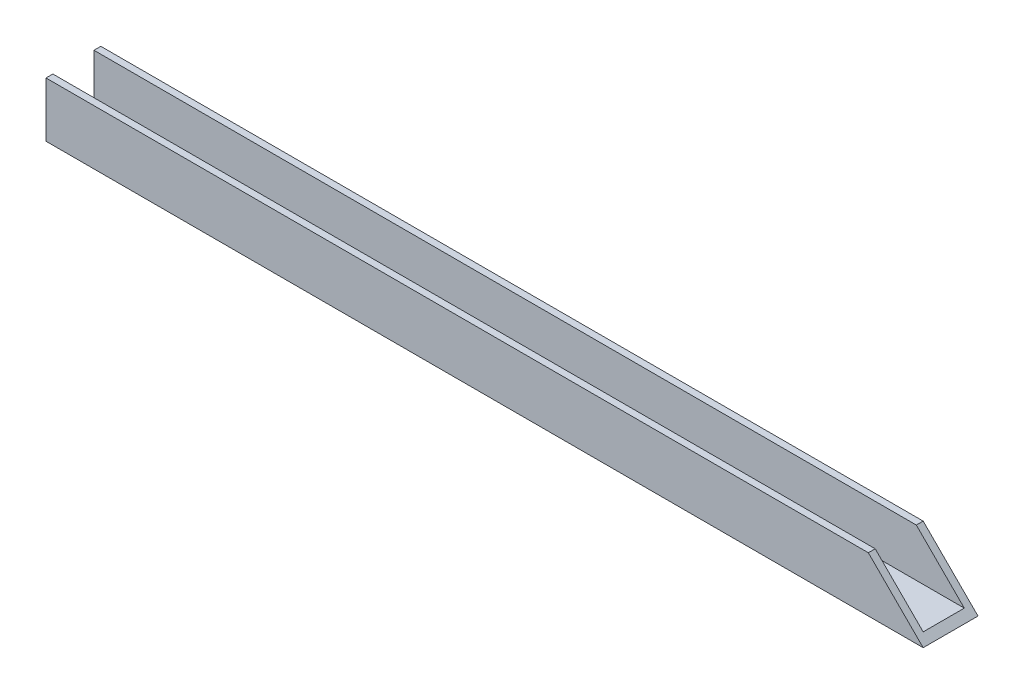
from build123d import *

# Parameters (mm, degrees)
BOSS_EXTRUDE1_DEPTH = 406.4
SKETCH2_OUTSIDE_W   = 489.996
SKETCH2_OUTSIDE_H   = 108.996
CUT_EXTRUDE1_DEPTH  = 406.4


with BuildPart() as part:
    # Sketch1 → Boss-Extrude1 (new body)
    with BuildSketch(Plane(origin=(0, 0, 0), x_dir=(0, 0, -1), z_dir=(1, 0, 0))):
        Polygon((-9.525, 0), (9.525, 0), (9.525, 22.225), (12.7, 22.225), (12.7, -3.175), (-12.7, -3.175), (-12.7, 22.225), (-9.525, 22.225), align=None)
    extrude(amount=BOSS_EXTRUDE1_DEPTH)

    # Sketch2 outside → Cut-Extrude1 (cut)
    with BuildSketch(Plane.XY.offset(12.7)):
        with Locations((203.2, 9.525)):
            Rectangle(SKETCH2_OUTSIDE_W, SKETCH2_OUTSIDE_H)
        Polygon((0, -3.175), (406.4, -3.175), (381, 22.225), (0, 22.225), align=None, mode=Mode.SUBTRACT)
    extrude(amount=-CUT_EXTRUDE1_DEPTH, mode=Mode.SUBTRACT)


solid = part.part
